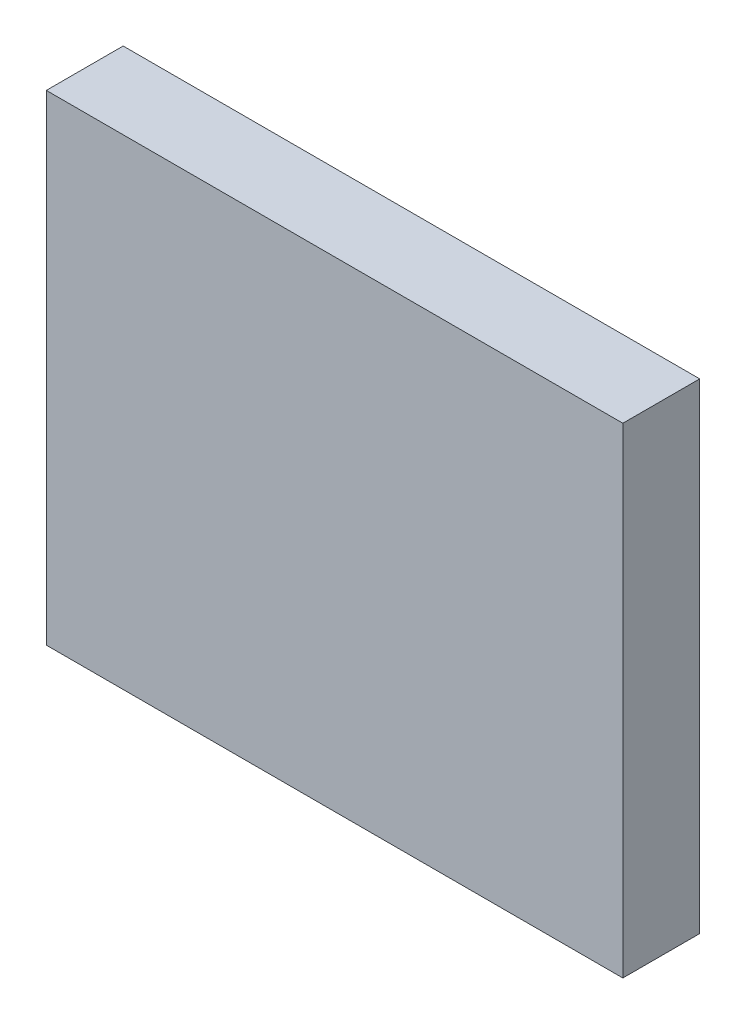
from build123d import *

# Parameters (mm, degrees)
SKETCH_1_W      = 60
SKETCH_1_H      = 50
EXTRUDE_1_DEPTH = 8


with BuildPart() as part:
    # Sketch 1 → Extrude 1 (new body)
    with BuildSketch(Plane.XY):
        with Locations((30, 25)):
            Rectangle(SKETCH_1_W, SKETCH_1_H)
    extrude(amount=EXTRUDE_1_DEPTH)


solid = part.part
